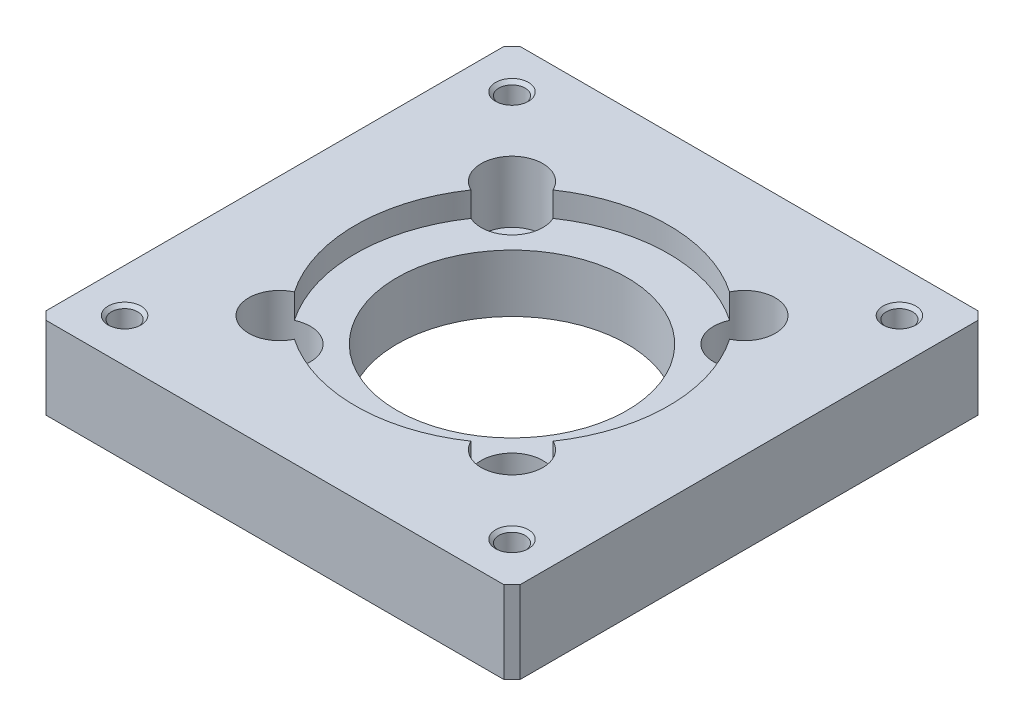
ISO-10303-21;
HEADER;
FILE_DESCRIPTION(('STEP AP214'),'2;1');
FILE_NAME('part.step','',(''),(''),'','','');
FILE_SCHEMA(('AUTOMOTIVE_DESIGN { 1 0 10303 214 1 1 1 1 }'));
ENDSEC;
DATA;
#1=APPLICATION_CONTEXT('core data for automotive mechanical design processes');
#2=APPLICATION_PROTOCOL_DEFINITION('international standard','automotive_design',2000,#1);
#3=PRODUCT_CONTEXT('',#1,'mechanical');
#4=PRODUCT('Part','Part','',(#3));
#5=PRODUCT_RELATED_PRODUCT_CATEGORY('part','',(#4));
#6=PRODUCT_DEFINITION_FORMATION('','',#4);
#7=PRODUCT_DEFINITION_CONTEXT('part definition',#1,'design');
#8=PRODUCT_DEFINITION('design','',#6,#7);
#9=PRODUCT_DEFINITION_SHAPE('','',#8);
#10=(LENGTH_UNIT() NAMED_UNIT(*) SI_UNIT(.MILLI.,.METRE.));
#11=(NAMED_UNIT(*) PLANE_ANGLE_UNIT() SI_UNIT($,.RADIAN.));
#12=(NAMED_UNIT(*) SI_UNIT($,.STERADIAN.) SOLID_ANGLE_UNIT());
#13=UNCERTAINTY_MEASURE_WITH_UNIT(LENGTH_MEASURE(1.E-05),#10,'distance_accuracy_value','');
#14=(GEOMETRIC_REPRESENTATION_CONTEXT(3) GLOBAL_UNCERTAINTY_ASSIGNED_CONTEXT((#13)) GLOBAL_UNIT_ASSIGNED_CONTEXT((#10,
#11,#12)) REPRESENTATION_CONTEXT('',''));
#15=CARTESIAN_POINT('',(0.,0.,0.));
#16=DIRECTION('',(0.,0.,1.));
#17=DIRECTION('',(1.,0.,0.));
#18=AXIS2_PLACEMENT_3D('',#15,#16,#17);
#19=CARTESIAN_POINT('',(-23.57,9.59999999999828,23.57));
#20=DIRECTION('',(0.,1.,0.));
#21=DIRECTION('',(0.,0.,1.));
#22=AXIS2_PLACEMENT_3D('',#19,#20,#21);
#23=CONICAL_SURFACE('',#22,1.60000000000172,0.785398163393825);
#24=CARTESIAN_POINT('',(-23.57,9.6,23.57));
#25=DIRECTION('',(0.,1.,0.));
#26=DIRECTION('',(1.,0.,0.));
#27=AXIS2_PLACEMENT_3D('',#24,#25,#26);
#28=CIRCLE('',#27,1.6);
#29=CARTESIAN_POINT('',(-21.97,9.6,23.57));
#30=VERTEX_POINT('',#29);
#31=EDGE_CURVE('E180',#30,#30,#28,.F.);
#32=ORIENTED_EDGE('',*,*,#31,.T.);
#33=EDGE_LOOP('',(#32));
#34=FACE_BOUND('',#33,.T.);
#35=CARTESIAN_POINT('',(-23.57,9.99999999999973,23.57));
#36=DIRECTION('',(0.,1.,0.));
#37=DIRECTION('',(-1.,0.,0.));
#38=AXIS2_PLACEMENT_3D('',#35,#36,#37);
#39=CIRCLE('',#38,2.00000000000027);
#40=CARTESIAN_POINT('',(-25.5700000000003,9.99999999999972,23.57));
#41=VERTEX_POINT('',#40);
#42=EDGE_CURVE('E204',#41,#41,#39,.T.);
#43=ORIENTED_EDGE('',*,*,#42,.T.);
#44=EDGE_LOOP('',(#43));
#45=FACE_BOUND('',#44,.T.);
#46=ADVANCED_FACE('F16',(#34,#45),#23,.F.);
#47=CARTESIAN_POINT('',(23.57,9.59999999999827,23.57));
#48=DIRECTION('',(0.,1.,0.));
#49=DIRECTION('',(-1.,0.,0.));
#50=AXIS2_PLACEMENT_3D('',#47,#48,#49);
#51=CONICAL_SURFACE('',#50,1.60000000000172,0.785398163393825);
#52=CARTESIAN_POINT('',(23.57,9.6,23.57));
#53=DIRECTION('',(0.,1.,0.));
#54=DIRECTION('',(1.,0.,0.));
#55=AXIS2_PLACEMENT_3D('',#52,#53,#54);
#56=CIRCLE('',#55,1.6);
#57=CARTESIAN_POINT('',(25.17,9.6,23.57));
#58=VERTEX_POINT('',#57);
#59=EDGE_CURVE('E253',#58,#58,#56,.F.);
#60=ORIENTED_EDGE('',*,*,#59,.T.);
#61=EDGE_LOOP('',(#60));
#62=FACE_BOUND('',#61,.T.);
#63=CARTESIAN_POINT('',(23.57,9.99999999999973,23.57));
#64=DIRECTION('',(0.,1.,0.));
#65=DIRECTION('',(-1.,0.,0.));
#66=AXIS2_PLACEMENT_3D('',#63,#64,#65);
#67=CIRCLE('',#66,2.00000000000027);
#68=CARTESIAN_POINT('',(21.5699999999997,9.99999999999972,23.57));
#69=VERTEX_POINT('',#68);
#70=EDGE_CURVE('E201',#69,#69,#67,.T.);
#71=ORIENTED_EDGE('',*,*,#70,.T.);
#72=EDGE_LOOP('',(#71));
#73=FACE_BOUND('',#72,.T.);
#74=ADVANCED_FACE('F442',(#62,#73),#51,.F.);
#75=CARTESIAN_POINT('',(23.57,9.59999999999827,-23.57));
#76=DIRECTION('',(0.,1.,0.));
#77=DIRECTION('',(0.,0.,1.));
#78=AXIS2_PLACEMENT_3D('',#75,#76,#77);
#79=CONICAL_SURFACE('',#78,1.60000000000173,0.785398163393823);
#80=CARTESIAN_POINT('',(23.57,9.6,-23.57));
#81=DIRECTION('',(0.,1.,0.));
#82=DIRECTION('',(1.,0.,0.));
#83=AXIS2_PLACEMENT_3D('',#80,#81,#82);
#84=CIRCLE('',#83,1.6);
#85=CARTESIAN_POINT('',(25.17,9.6,-23.57));
#86=VERTEX_POINT('',#85);
#87=EDGE_CURVE('E250',#86,#86,#84,.F.);
#88=ORIENTED_EDGE('',*,*,#87,.T.);
#89=EDGE_LOOP('',(#88));
#90=FACE_BOUND('',#89,.T.);
#91=CARTESIAN_POINT('',(23.57,9.99999999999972,-23.57));
#92=DIRECTION('',(0.,1.,0.));
#93=DIRECTION('',(0.,0.,1.));
#94=AXIS2_PLACEMENT_3D('',#91,#92,#93);
#95=CIRCLE('',#94,2.00000000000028);
#96=CARTESIAN_POINT('',(23.57,9.99999999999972,-21.5699999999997));
#97=VERTEX_POINT('',#96);
#98=EDGE_CURVE('E207',#97,#97,#95,.T.);
#99=ORIENTED_EDGE('',*,*,#98,.T.);
#100=EDGE_LOOP('',(#99));
#101=FACE_BOUND('',#100,.T.);
#102=ADVANCED_FACE('F482',(#90,#101),#79,.F.);
#103=CARTESIAN_POINT('',(-23.57,9.59999999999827,-23.57));
#104=DIRECTION('',(0.,1.,0.));
#105=DIRECTION('',(0.,0.,1.));
#106=AXIS2_PLACEMENT_3D('',#103,#104,#105);
#107=CONICAL_SURFACE('',#106,1.60000000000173,0.785398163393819);
#108=CARTESIAN_POINT('',(-23.57,9.6,-23.57));
#109=DIRECTION('',(0.,1.,0.));
#110=DIRECTION('',(1.,0.,0.));
#111=AXIS2_PLACEMENT_3D('',#108,#109,#110);
#112=CIRCLE('',#111,1.6);
#113=CARTESIAN_POINT('',(-21.97,9.6,-23.57));
#114=VERTEX_POINT('',#113);
#115=EDGE_CURVE('E176',#114,#114,#112,.F.);
#116=ORIENTED_EDGE('',*,*,#115,.T.);
#117=EDGE_LOOP('',(#116));
#118=FACE_BOUND('',#117,.T.);
#119=CARTESIAN_POINT('',(-23.57,9.99999999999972,-23.57));
#120=DIRECTION('',(0.,1.,0.));
#121=DIRECTION('',(0.,0.,1.));
#122=AXIS2_PLACEMENT_3D('',#119,#120,#121);
#123=CIRCLE('',#122,2.00000000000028);
#124=CARTESIAN_POINT('',(-23.57,9.99999999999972,-21.5699999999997));
#125=VERTEX_POINT('',#124);
#126=EDGE_CURVE('E177',#125,#125,#123,.T.);
#127=ORIENTED_EDGE('',*,*,#126,.T.);
#128=EDGE_LOOP('',(#127));
#129=FACE_BOUND('',#128,.T.);
#130=ADVANCED_FACE('F488',(#118,#129),#107,.F.);
#131=CARTESIAN_POINT('',(14.14213562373,2.5,-14.14213562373));
#132=DIRECTION('',(0.,1.,0.));
#133=DIRECTION('',(0.,0.,1.));
#134=AXIS2_PLACEMENT_3D('',#131,#132,#133);
#135=CYLINDRICAL_SURFACE('',#134,3.75);
#136=CARTESIAN_POINT('',(14.14213562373,2.5,-14.14213562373));
#137=DIRECTION('',(0.,1.,0.));
#138=DIRECTION('',(0.,0.,1.));
#139=AXIS2_PLACEMENT_3D('',#136,#137,#138);
#140=CIRCLE('',#139,3.75);
#141=CARTESIAN_POINT('',(14.14213562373,2.5,-10.39213562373));
#142=VERTEX_POINT('',#141);
#143=EDGE_CURVE('E173',#142,#142,#140,.F.);
#144=ORIENTED_EDGE('',*,*,#143,.T.);
#145=EDGE_LOOP('',(#144));
#146=FACE_BOUND('',#145,.T.);
#147=DIRECTION('',(0.,1.,0.));
#148=VECTOR('',#147,1.);
#149=CARTESIAN_POINT('',(10.7450909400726,8.4999999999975,-15.7304011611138));
#150=LINE('',#149,#148);
#151=CARTESIAN_POINT('',(10.7450909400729,10.,-15.7304011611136));
#152=VERTEX_POINT('',#151);
#153=CARTESIAN_POINT('',(10.7450909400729,7.,-15.7304011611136));
#154=VERTEX_POINT('',#153);
#155=EDGE_CURVE('E235',#152,#154,#150,.F.);
#156=ORIENTED_EDGE('',*,*,#155,.T.);
#157=CARTESIAN_POINT('',(14.14213562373,7.,-14.14213562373));
#158=DIRECTION('',(0.,1.,0.));
#159=DIRECTION('',(0.,0.,1.));
#160=AXIS2_PLACEMENT_3D('',#157,#158,#159);
#161=CIRCLE('',#160,3.75);
#162=CARTESIAN_POINT('',(15.7304011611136,7.,-10.7450909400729));
#163=VERTEX_POINT('',#162);
#164=EDGE_CURVE('E161',#154,#163,#161,.T.);
#165=ORIENTED_EDGE('',*,*,#164,.T.);
#166=DIRECTION('',(0.,-1.,0.));
#167=VECTOR('',#166,1.);
#168=CARTESIAN_POINT('',(15.7304011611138,8.4999999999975,-10.7450909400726));
#169=LINE('',#168,#167);
#170=CARTESIAN_POINT('',(15.7304011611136,10.,-10.7450909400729));
#171=VERTEX_POINT('',#170);
#172=EDGE_CURVE('E246',#163,#171,#169,.F.);
#173=ORIENTED_EDGE('',*,*,#172,.T.);
#174=CARTESIAN_POINT('',(14.14213562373,10.,-14.14213562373));
#175=DIRECTION('',(0.,1.,0.));
#176=DIRECTION('',(0.,0.,1.));
#177=AXIS2_PLACEMENT_3D('',#174,#175,#176);
#178=CIRCLE('',#177,3.75);
#179=EDGE_CURVE('E181',#171,#152,#178,.T.);
#180=ORIENTED_EDGE('',*,*,#179,.T.);
#181=EDGE_LOOP('',(#156,#165,#173,#180));
#182=FACE_BOUND('',#181,.T.);
#183=ADVANCED_FACE('F351',(#146,#182),#135,.F.);
#184=CARTESIAN_POINT('',(0.,7.,0.));
#185=DIRECTION('',(0.,1.,0.));
#186=DIRECTION('',(0.,0.,1.));
#187=AXIS2_PLACEMENT_3D('',#184,#185,#186);
#188=CYLINDRICAL_SURFACE('',#187,19.05);
#189=DIRECTION('',(0.,-1.,0.));
#190=VECTOR('',#189,1.);
#191=CARTESIAN_POINT('',(15.7304011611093,6.25,10.7450909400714));
#192=LINE('',#191,#190);
#193=CARTESIAN_POINT('',(15.7304011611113,7.,10.7450909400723));
#194=VERTEX_POINT('',#193);
#195=CARTESIAN_POINT('',(15.7304011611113,10.,10.7450909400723));
#196=VERTEX_POINT('',#195);
#197=EDGE_CURVE('E133',#194,#196,#192,.F.);
#198=ORIENTED_EDGE('',*,*,#197,.T.);
#199=CARTESIAN_POINT('',(0.,10.,0.));
#200=DIRECTION('',(0.,1.,0.));
#201=DIRECTION('',(0.,0.,1.));
#202=AXIS2_PLACEMENT_3D('',#199,#200,#201);
#203=CIRCLE('',#202,19.05);
#204=EDGE_CURVE('E183',#196,#171,#203,.T.);
#205=ORIENTED_EDGE('',*,*,#204,.T.);
#206=ORIENTED_EDGE('',*,*,#172,.F.);
#207=CARTESIAN_POINT('',(0.,7.,0.));
#208=DIRECTION('',(0.,1.,0.));
#209=DIRECTION('',(0.,0.,1.));
#210=AXIS2_PLACEMENT_3D('',#207,#208,#209);
#211=CIRCLE('',#210,19.05);
#212=EDGE_CURVE('E139',#163,#194,#211,.F.);
#213=ORIENTED_EDGE('',*,*,#212,.T.);
#214=EDGE_LOOP('',(#198,#205,#206,#213));
#215=FACE_BOUND('',#214,.T.);
#216=ADVANCED_FACE('F348',(#215),#188,.F.);
#217=CARTESIAN_POINT('',(14.14213562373,2.5,14.14213562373));
#218=DIRECTION('',(0.,1.,0.));
#219=DIRECTION('',(0.,0.,1.));
#220=AXIS2_PLACEMENT_3D('',#217,#218,#219);
#221=CYLINDRICAL_SURFACE('',#220,3.75);
#222=CARTESIAN_POINT('',(14.14213562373,2.5,14.14213562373));
#223=DIRECTION('',(0.,1.,0.));
#224=DIRECTION('',(0.,0.,1.));
#225=AXIS2_PLACEMENT_3D('',#222,#223,#224);
#226=CIRCLE('',#225,3.75);
#227=CARTESIAN_POINT('',(14.14213562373,2.5,17.89213562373));
#228=VERTEX_POINT('',#227);
#229=EDGE_CURVE('E170',#228,#228,#226,.F.);
#230=ORIENTED_EDGE('',*,*,#229,.T.);
#231=EDGE_LOOP('',(#230));
#232=FACE_BOUND('',#231,.T.);
#233=CARTESIAN_POINT('',(14.14213562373,7.,14.14213562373));
#234=DIRECTION('',(0.,1.,0.));
#235=DIRECTION('',(0.,0.,1.));
#236=AXIS2_PLACEMENT_3D('',#233,#234,#235);
#237=CIRCLE('',#236,3.75);
#238=CARTESIAN_POINT('',(10.7450909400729,7.,15.7304011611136));
#239=VERTEX_POINT('',#238);
#240=EDGE_CURVE('E127',#194,#239,#237,.T.);
#241=ORIENTED_EDGE('',*,*,#240,.T.);
#242=DIRECTION('',(0.,-1.,0.));
#243=VECTOR('',#242,1.);
#244=CARTESIAN_POINT('',(10.7450909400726,8.4999999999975,15.7304011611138));
#245=LINE('',#244,#243);
#246=CARTESIAN_POINT('',(10.7450909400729,10.,15.7304011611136));
#247=VERTEX_POINT('',#246);
#248=EDGE_CURVE('E131',#239,#247,#245,.F.);
#249=ORIENTED_EDGE('',*,*,#248,.T.);
#250=CARTESIAN_POINT('',(14.14213562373,10.,14.14213562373));
#251=DIRECTION('',(0.,1.,0.));
#252=DIRECTION('',(0.,0.,1.));
#253=AXIS2_PLACEMENT_3D('',#250,#251,#252);
#254=CIRCLE('',#253,3.75);
#255=EDGE_CURVE('E186',#247,#196,#254,.T.);
#256=ORIENTED_EDGE('',*,*,#255,.T.);
#257=ORIENTED_EDGE('',*,*,#197,.F.);
#258=EDGE_LOOP('',(#241,#249,#256,#257));
#259=FACE_BOUND('',#258,.T.);
#260=ADVANCED_FACE('F129',(#232,#259),#221,.F.);
#261=CARTESIAN_POINT('',(0.,7.,0.));
#262=DIRECTION('',(0.,1.,0.));
#263=DIRECTION('',(0.,0.,1.));
#264=AXIS2_PLACEMENT_3D('',#261,#262,#263);
#265=CYLINDRICAL_SURFACE('',#264,19.05);
#266=ORIENTED_EDGE('',*,*,#248,.F.);
#267=CARTESIAN_POINT('',(0.,7.,0.));
#268=DIRECTION('',(0.,1.,0.));
#269=DIRECTION('',(0.,0.,1.));
#270=AXIS2_PLACEMENT_3D('',#267,#268,#269);
#271=CIRCLE('',#270,19.05);
#272=CARTESIAN_POINT('',(-10.7450909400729,7.,15.7304011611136));
#273=VERTEX_POINT('',#272);
#274=EDGE_CURVE('E138',#239,#273,#271,.F.);
#275=ORIENTED_EDGE('',*,*,#274,.T.);
#276=DIRECTION('',(0.,1.,0.));
#277=VECTOR('',#276,1.);
#278=CARTESIAN_POINT('',(-10.7450909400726,8.4999999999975,15.7304011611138));
#279=LINE('',#278,#277);
#280=CARTESIAN_POINT('',(-10.7450909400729,10.,15.7304011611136));
#281=VERTEX_POINT('',#280);
#282=EDGE_CURVE('E147',#281,#273,#279,.F.);
#283=ORIENTED_EDGE('',*,*,#282,.F.);
#284=CARTESIAN_POINT('',(0.,10.,0.));
#285=DIRECTION('',(0.,1.,0.));
#286=DIRECTION('',(0.,0.,1.));
#287=AXIS2_PLACEMENT_3D('',#284,#285,#286);
#288=CIRCLE('',#287,19.05);
#289=EDGE_CURVE('E145',#281,#247,#288,.T.);
#290=ORIENTED_EDGE('',*,*,#289,.T.);
#291=EDGE_LOOP('',(#266,#275,#283,#290));
#292=FACE_BOUND('',#291,.T.);
#293=ADVANCED_FACE('F143',(#292),#265,.F.);
#294=CARTESIAN_POINT('',(-14.14213562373,2.5,14.14213562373));
#295=DIRECTION('',(0.,1.,0.));
#296=DIRECTION('',(0.,0.,1.));
#297=AXIS2_PLACEMENT_3D('',#294,#295,#296);
#298=CYLINDRICAL_SURFACE('',#297,3.75);
#299=CARTESIAN_POINT('',(-14.14213562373,2.5,14.14213562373));
#300=DIRECTION('',(0.,1.,0.));
#301=DIRECTION('',(0.,0.,1.));
#302=AXIS2_PLACEMENT_3D('',#299,#300,#301);
#303=CIRCLE('',#302,3.75);
#304=CARTESIAN_POINT('',(-14.14213562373,2.5,17.89213562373));
#305=VERTEX_POINT('',#304);
#306=EDGE_CURVE('E164',#305,#305,#303,.F.);
#307=ORIENTED_EDGE('',*,*,#306,.T.);
#308=EDGE_LOOP('',(#307));
#309=FACE_BOUND('',#308,.T.);
#310=ORIENTED_EDGE('',*,*,#282,.T.);
#311=CARTESIAN_POINT('',(-14.14213562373,7.,14.14213562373));
#312=DIRECTION('',(0.,1.,0.));
#313=DIRECTION('',(0.,0.,1.));
#314=AXIS2_PLACEMENT_3D('',#311,#312,#313);
#315=CIRCLE('',#314,3.75);
#316=CARTESIAN_POINT('',(-15.7304011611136,7.,10.7450909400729));
#317=VERTEX_POINT('',#316);
#318=EDGE_CURVE('E153',#273,#317,#315,.T.);
#319=ORIENTED_EDGE('',*,*,#318,.T.);
#320=DIRECTION('',(0.,-1.,0.));
#321=VECTOR('',#320,1.);
#322=CARTESIAN_POINT('',(-15.7304011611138,8.4999999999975,10.7450909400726));
#323=LINE('',#322,#321);
#324=CARTESIAN_POINT('',(-15.7304011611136,10.,10.7450909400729));
#325=VERTEX_POINT('',#324);
#326=EDGE_CURVE('E146',#317,#325,#323,.F.);
#327=ORIENTED_EDGE('',*,*,#326,.T.);
#328=CARTESIAN_POINT('',(-14.14213562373,10.,14.14213562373));
#329=DIRECTION('',(0.,1.,0.));
#330=DIRECTION('',(0.,0.,1.));
#331=AXIS2_PLACEMENT_3D('',#328,#329,#330);
#332=CIRCLE('',#331,3.75);
#333=EDGE_CURVE('E189',#325,#281,#332,.T.);
#334=ORIENTED_EDGE('',*,*,#333,.T.);
#335=EDGE_LOOP('',(#310,#319,#327,#334));
#336=FACE_BOUND('',#335,.T.);
#337=ADVANCED_FACE('F340',(#309,#336),#298,.F.);
#338=CARTESIAN_POINT('',(0.,7.,0.));
#339=DIRECTION('',(0.,1.,0.));
#340=DIRECTION('',(0.,0.,1.));
#341=AXIS2_PLACEMENT_3D('',#338,#339,#340);
#342=CYLINDRICAL_SURFACE('',#341,19.05);
#343=ORIENTED_EDGE('',*,*,#326,.F.);
#344=CARTESIAN_POINT('',(0.,7.,0.));
#345=DIRECTION('',(0.,1.,0.));
#346=DIRECTION('',(0.,0.,1.));
#347=AXIS2_PLACEMENT_3D('',#344,#345,#346);
#348=CIRCLE('',#347,19.05);
#349=CARTESIAN_POINT('',(-15.7304011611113,7.,-10.7450909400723));
#350=VERTEX_POINT('',#349);
#351=EDGE_CURVE('E156',#317,#350,#348,.F.);
#352=ORIENTED_EDGE('',*,*,#351,.T.);
#353=DIRECTION('',(0.,-1.,0.));
#354=VECTOR('',#353,1.);
#355=CARTESIAN_POINT('',(-15.7304011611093,6.25,-10.7450909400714));
#356=LINE('',#355,#354);
#357=CARTESIAN_POINT('',(-15.7304011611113,10.,-10.7450909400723));
#358=VERTEX_POINT('',#357);
#359=EDGE_CURVE('E238',#350,#358,#356,.F.);
#360=ORIENTED_EDGE('',*,*,#359,.T.);
#361=CARTESIAN_POINT('',(0.,10.,0.));
#362=DIRECTION('',(0.,1.,0.));
#363=DIRECTION('',(0.,0.,1.));
#364=AXIS2_PLACEMENT_3D('',#361,#362,#363);
#365=CIRCLE('',#364,19.05);
#366=EDGE_CURVE('E192',#358,#325,#365,.T.);
#367=ORIENTED_EDGE('',*,*,#366,.T.);
#368=EDGE_LOOP('',(#343,#352,#360,#367));
#369=FACE_BOUND('',#368,.T.);
#370=ADVANCED_FACE('F336',(#369),#342,.F.);
#371=CARTESIAN_POINT('',(-14.14213562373,2.5,-14.14213562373));
#372=DIRECTION('',(0.,1.,0.));
#373=DIRECTION('',(0.,0.,1.));
#374=AXIS2_PLACEMENT_3D('',#371,#372,#373);
#375=CYLINDRICAL_SURFACE('',#374,3.75);
#376=CARTESIAN_POINT('',(-14.14213562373,2.5,-14.14213562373));
#377=DIRECTION('',(0.,1.,0.));
#378=DIRECTION('',(0.,0.,1.));
#379=AXIS2_PLACEMENT_3D('',#376,#377,#378);
#380=CIRCLE('',#379,3.75);
#381=CARTESIAN_POINT('',(-14.14213562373,2.5,-10.39213562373));
#382=VERTEX_POINT('',#381);
#383=EDGE_CURVE('E167',#382,#382,#380,.F.);
#384=ORIENTED_EDGE('',*,*,#383,.T.);
#385=EDGE_LOOP('',(#384));
#386=FACE_BOUND('',#385,.T.);
#387=CARTESIAN_POINT('',(-14.14213562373,7.,-14.14213562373));
#388=DIRECTION('',(0.,1.,0.));
#389=DIRECTION('',(0.,0.,1.));
#390=AXIS2_PLACEMENT_3D('',#387,#388,#389);
#391=CIRCLE('',#390,3.75);
#392=CARTESIAN_POINT('',(-10.7450909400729,7.,-15.7304011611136));
#393=VERTEX_POINT('',#392);
#394=EDGE_CURVE('E333',#350,#393,#391,.T.);
#395=ORIENTED_EDGE('',*,*,#394,.T.);
#396=DIRECTION('',(0.,-1.,0.));
#397=VECTOR('',#396,1.);
#398=CARTESIAN_POINT('',(-10.7450909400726,8.4999999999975,-15.7304011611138));
#399=LINE('',#398,#397);
#400=CARTESIAN_POINT('',(-10.7450909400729,10.,-15.7304011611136));
#401=VERTEX_POINT('',#400);
#402=EDGE_CURVE('E234',#393,#401,#399,.F.);
#403=ORIENTED_EDGE('',*,*,#402,.T.);
#404=CARTESIAN_POINT('',(-14.14213562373,10.,-14.14213562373));
#405=DIRECTION('',(0.,1.,0.));
#406=DIRECTION('',(0.,0.,1.));
#407=AXIS2_PLACEMENT_3D('',#404,#405,#406);
#408=CIRCLE('',#407,3.75);
#409=EDGE_CURVE('E195',#401,#358,#408,.T.);
#410=ORIENTED_EDGE('',*,*,#409,.T.);
#411=ORIENTED_EDGE('',*,*,#359,.F.);
#412=EDGE_LOOP('',(#395,#403,#410,#411));
#413=FACE_BOUND('',#412,.T.);
#414=ADVANCED_FACE('F357',(#386,#413),#375,.F.);
#415=CARTESIAN_POINT('',(0.,7.,0.));
#416=DIRECTION('',(0.,1.,0.));
#417=DIRECTION('',(0.,0.,1.));
#418=AXIS2_PLACEMENT_3D('',#415,#416,#417);
#419=CYLINDRICAL_SURFACE('',#418,19.05);
#420=ORIENTED_EDGE('',*,*,#402,.F.);
#421=CARTESIAN_POINT('',(0.,7.,0.));
#422=DIRECTION('',(0.,1.,0.));
#423=DIRECTION('',(0.,0.,1.));
#424=AXIS2_PLACEMENT_3D('',#421,#422,#423);
#425=CIRCLE('',#424,19.05);
#426=EDGE_CURVE('E288',#393,#154,#425,.F.);
#427=ORIENTED_EDGE('',*,*,#426,.T.);
#428=ORIENTED_EDGE('',*,*,#155,.F.);
#429=CARTESIAN_POINT('',(0.,10.,0.));
#430=DIRECTION('',(0.,1.,0.));
#431=DIRECTION('',(0.,0.,1.));
#432=AXIS2_PLACEMENT_3D('',#429,#430,#431);
#433=CIRCLE('',#432,19.05);
#434=EDGE_CURVE('E198',#152,#401,#433,.T.);
#435=ORIENTED_EDGE('',*,*,#434,.T.);
#436=EDGE_LOOP('',(#420,#427,#428,#435));
#437=FACE_BOUND('',#436,.T.);
#438=ADVANCED_FACE('F355',(#437),#419,.F.);
#439=CARTESIAN_POINT('',(-28.926164,10.2,-27.773836));
#440=DIRECTION('',(-0.707106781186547,0.,-0.707106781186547));
#441=DIRECTION('',(0.707106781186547,0.,-0.707106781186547));
#442=AXIS2_PLACEMENT_3D('',#439,#440,#441);
#443=PLANE('',#442);
#444=DIRECTION('',(0.707106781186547,0.,-0.707106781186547));
#445=VECTOR('',#444,1.);
#446=CARTESIAN_POINT('',(-28.926164,10.,-27.773836));
#447=LINE('',#446,#445);
#448=CARTESIAN_POINT('',(-28.85,10.,-27.85));
#449=VERTEX_POINT('',#448);
#450=CARTESIAN_POINT('',(-27.85,10.,-28.85));
#451=VERTEX_POINT('',#450);
#452=EDGE_CURVE('E210',#449,#451,#447,.T.);
#453=ORIENTED_EDGE('',*,*,#452,.T.);
#454=DIRECTION('',(0.,1.,0.));
#455=VECTOR('',#454,1.);
#456=CARTESIAN_POINT('',(-27.85,5.,-28.85));
#457=LINE('',#456,#455);
#458=CARTESIAN_POINT('',(-27.85,0.,-28.85));
#459=VERTEX_POINT('',#458);
#460=EDGE_CURVE('E265',#451,#459,#457,.F.);
#461=ORIENTED_EDGE('',*,*,#460,.T.);
#462=DIRECTION('',(-0.707106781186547,0.,0.707106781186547));
#463=VECTOR('',#462,1.);
#464=CARTESIAN_POINT('',(-28.35,0.,-28.35));
#465=LINE('',#464,#463);
#466=CARTESIAN_POINT('',(-28.85,0.,-27.85));
#467=VERTEX_POINT('',#466);
#468=EDGE_CURVE('E232',#467,#459,#465,.F.);
#469=ORIENTED_EDGE('',*,*,#468,.F.);
#470=DIRECTION('',(0.,-1.,0.));
#471=VECTOR('',#470,1.);
#472=CARTESIAN_POINT('',(-28.85,5.,-27.85));
#473=LINE('',#472,#471);
#474=EDGE_CURVE('E262',#467,#449,#473,.F.);
#475=ORIENTED_EDGE('',*,*,#474,.T.);
#476=EDGE_LOOP('',(#453,#461,#469,#475));
#477=FACE_BOUND('',#476,.T.);
#478=ADVANCED_FACE('F366',(#477),#443,.T.);
#479=CARTESIAN_POINT('',(-27.773836,10.2,28.926164));
#480=DIRECTION('',(-0.707106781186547,0.,0.707106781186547));
#481=DIRECTION('',(-0.707106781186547,0.,-0.707106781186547));
#482=AXIS2_PLACEMENT_3D('',#479,#480,#481);
#483=PLANE('',#482);
#484=DIRECTION('',(-0.707106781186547,0.,-0.707106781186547));
#485=VECTOR('',#484,1.);
#486=CARTESIAN_POINT('',(-27.773836,10.,28.926164));
#487=LINE('',#486,#485);
#488=CARTESIAN_POINT('',(-27.85,10.,28.85));
#489=VERTEX_POINT('',#488);
#490=CARTESIAN_POINT('',(-28.85,10.,27.85));
#491=VERTEX_POINT('',#490);
#492=EDGE_CURVE('E212',#489,#491,#487,.T.);
#493=ORIENTED_EDGE('',*,*,#492,.T.);
#494=DIRECTION('',(0.,1.,0.));
#495=VECTOR('',#494,1.);
#496=CARTESIAN_POINT('',(-28.85,5.,27.85));
#497=LINE('',#496,#495);
#498=CARTESIAN_POINT('',(-28.85,0.,27.85));
#499=VERTEX_POINT('',#498);
#500=EDGE_CURVE('E261',#491,#499,#497,.F.);
#501=ORIENTED_EDGE('',*,*,#500,.T.);
#502=DIRECTION('',(0.707106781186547,0.,0.707106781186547));
#503=VECTOR('',#502,1.);
#504=CARTESIAN_POINT('',(-28.35,0.,28.35));
#505=LINE('',#504,#503);
#506=CARTESIAN_POINT('',(-27.85,0.,28.85));
#507=VERTEX_POINT('',#506);
#508=EDGE_CURVE('E225',#507,#499,#505,.F.);
#509=ORIENTED_EDGE('',*,*,#508,.F.);
#510=DIRECTION('',(0.,-1.,0.));
#511=VECTOR('',#510,1.);
#512=CARTESIAN_POINT('',(-27.85,5.,28.85));
#513=LINE('',#512,#511);
#514=EDGE_CURVE('E276',#507,#489,#513,.F.);
#515=ORIENTED_EDGE('',*,*,#514,.T.);
#516=EDGE_LOOP('',(#493,#501,#509,#515));
#517=FACE_BOUND('',#516,.T.);
#518=ADVANCED_FACE('F495',(#517),#483,.T.);
#519=CARTESIAN_POINT('',(27.773836,10.2,-28.926164));
#520=DIRECTION('',(0.707106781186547,0.,-0.707106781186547));
#521=DIRECTION('',(0.707106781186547,0.,0.707106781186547));
#522=AXIS2_PLACEMENT_3D('',#519,#520,#521);
#523=PLANE('',#522);
#524=DIRECTION('',(0.707106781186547,0.,0.707106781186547));
#525=VECTOR('',#524,1.);
#526=CARTESIAN_POINT('',(27.773836,10.,-28.926164));
#527=LINE('',#526,#525);
#528=CARTESIAN_POINT('',(27.85,10.,-28.85));
#529=VERTEX_POINT('',#528);
#530=CARTESIAN_POINT('',(28.85,10.,-27.85));
#531=VERTEX_POINT('',#530);
#532=EDGE_CURVE('E20',#529,#531,#527,.T.);
#533=ORIENTED_EDGE('',*,*,#532,.T.);
#534=DIRECTION('',(0.,1.,0.));
#535=VECTOR('',#534,1.);
#536=CARTESIAN_POINT('',(28.85,5.,-27.85));
#537=LINE('',#536,#535);
#538=CARTESIAN_POINT('',(28.85,0.,-27.85));
#539=VERTEX_POINT('',#538);
#540=EDGE_CURVE('E285',#531,#539,#537,.F.);
#541=ORIENTED_EDGE('',*,*,#540,.T.);
#542=DIRECTION('',(-0.707106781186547,0.,-0.707106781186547));
#543=VECTOR('',#542,1.);
#544=CARTESIAN_POINT('',(28.35,0.,-28.35));
#545=LINE('',#544,#543);
#546=CARTESIAN_POINT('',(27.85,0.,-28.85));
#547=VERTEX_POINT('',#546);
#548=EDGE_CURVE('E220',#547,#539,#545,.F.);
#549=ORIENTED_EDGE('',*,*,#548,.F.);
#550=DIRECTION('',(0.,-1.,0.));
#551=VECTOR('',#550,1.);
#552=CARTESIAN_POINT('',(27.85,5.,-28.85));
#553=LINE('',#552,#551);
#554=EDGE_CURVE('E271',#547,#529,#553,.F.);
#555=ORIENTED_EDGE('',*,*,#554,.T.);
#556=EDGE_LOOP('',(#533,#541,#549,#555));
#557=FACE_BOUND('',#556,.T.);
#558=ADVANCED_FACE('F498',(#557),#523,.T.);
#559=CARTESIAN_POINT('',(28.926164,10.2,27.773836));
#560=DIRECTION('',(0.707106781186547,0.,0.707106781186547));
#561=DIRECTION('',(-0.707106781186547,0.,0.707106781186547));
#562=AXIS2_PLACEMENT_3D('',#559,#560,#561);
#563=PLANE('',#562);
#564=DIRECTION('',(-0.707106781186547,0.,0.707106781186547));
#565=VECTOR('',#564,1.);
#566=CARTESIAN_POINT('',(28.926164,10.,27.773836));
#567=LINE('',#566,#565);
#568=CARTESIAN_POINT('',(28.85,10.,27.85));
#569=VERTEX_POINT('',#568);
#570=CARTESIAN_POINT('',(27.85,10.,28.85));
#571=VERTEX_POINT('',#570);
#572=EDGE_CURVE('E213',#569,#571,#567,.T.);
#573=ORIENTED_EDGE('',*,*,#572,.T.);
#574=DIRECTION('',(0.,1.,0.));
#575=VECTOR('',#574,1.);
#576=CARTESIAN_POINT('',(27.85,5.,28.85));
#577=LINE('',#576,#575);
#578=CARTESIAN_POINT('',(27.85,0.,28.85));
#579=VERTEX_POINT('',#578);
#580=EDGE_CURVE('E275',#571,#579,#577,.F.);
#581=ORIENTED_EDGE('',*,*,#580,.T.);
#582=DIRECTION('',(0.707106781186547,0.,-0.707106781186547));
#583=VECTOR('',#582,1.);
#584=CARTESIAN_POINT('',(28.35,0.,28.35));
#585=LINE('',#584,#583);
#586=CARTESIAN_POINT('',(28.85,0.,27.85));
#587=VERTEX_POINT('',#586);
#588=EDGE_CURVE('E35',#587,#579,#585,.F.);
#589=ORIENTED_EDGE('',*,*,#588,.F.);
#590=DIRECTION('',(0.,-1.,0.));
#591=VECTOR('',#590,1.);
#592=CARTESIAN_POINT('',(28.85,5.,27.85));
#593=LINE('',#592,#591);
#594=EDGE_CURVE('E283',#587,#569,#593,.F.);
#595=ORIENTED_EDGE('',*,*,#594,.T.);
#596=EDGE_LOOP('',(#573,#581,#589,#595));
#597=FACE_BOUND('',#596,.T.);
#598=ADVANCED_FACE('F433',(#597),#563,.T.);
#599=CARTESIAN_POINT('',(-30.004,10.,30.004));
#600=DIRECTION('',(0.,1.,0.));
#601=DIRECTION('',(1.,0.,0.));
#602=AXIS2_PLACEMENT_3D('',#599,#600,#601);
#603=PLANE('',#602);
#604=ORIENTED_EDGE('',*,*,#126,.F.);
#605=EDGE_LOOP('',(#604));
#606=FACE_BOUND('',#605,.T.);
#607=ORIENTED_EDGE('',*,*,#204,.F.);
#608=ORIENTED_EDGE('',*,*,#255,.F.);
#609=ORIENTED_EDGE('',*,*,#289,.F.);
#610=ORIENTED_EDGE('',*,*,#333,.F.);
#611=ORIENTED_EDGE('',*,*,#366,.F.);
#612=ORIENTED_EDGE('',*,*,#409,.F.);
#613=ORIENTED_EDGE('',*,*,#434,.F.);
#614=ORIENTED_EDGE('',*,*,#179,.F.);
#615=EDGE_LOOP('',(#607,#608,#609,#610,#611,#612,#613,#614));
#616=FACE_BOUND('',#615,.T.);
#617=ORIENTED_EDGE('',*,*,#70,.F.);
#618=EDGE_LOOP('',(#617));
#619=FACE_BOUND('',#618,.T.);
#620=ORIENTED_EDGE('',*,*,#42,.F.);
#621=EDGE_LOOP('',(#620));
#622=FACE_BOUND('',#621,.T.);
#623=ORIENTED_EDGE('',*,*,#98,.F.);
#624=EDGE_LOOP('',(#623));
#625=FACE_BOUND('',#624,.T.);
#626=ORIENTED_EDGE('',*,*,#452,.F.);
#627=DIRECTION('',(0.,0.,-1.));
#628=VECTOR('',#627,1.);
#629=CARTESIAN_POINT('',(-28.85,10.,0.));
#630=LINE('',#629,#628);
#631=EDGE_CURVE('E258',#449,#491,#630,.F.);
#632=ORIENTED_EDGE('',*,*,#631,.T.);
#633=ORIENTED_EDGE('',*,*,#492,.F.);
#634=DIRECTION('',(-1.,0.,0.));
#635=VECTOR('',#634,1.);
#636=CARTESIAN_POINT('',(0.,10.,28.85));
#637=LINE('',#636,#635);
#638=EDGE_CURVE('E272',#489,#571,#637,.F.);
#639=ORIENTED_EDGE('',*,*,#638,.T.);
#640=ORIENTED_EDGE('',*,*,#572,.F.);
#641=DIRECTION('',(0.,0.,1.));
#642=VECTOR('',#641,1.);
#643=CARTESIAN_POINT('',(28.85,10.,0.));
#644=LINE('',#643,#642);
#645=EDGE_CURVE('E281',#569,#531,#644,.F.);
#646=ORIENTED_EDGE('',*,*,#645,.T.);
#647=ORIENTED_EDGE('',*,*,#532,.F.);
#648=DIRECTION('',(1.,0.,0.));
#649=VECTOR('',#648,1.);
#650=CARTESIAN_POINT('',(0.,10.,-28.85));
#651=LINE('',#650,#649);
#652=EDGE_CURVE('E268',#529,#451,#651,.F.);
#653=ORIENTED_EDGE('',*,*,#652,.T.);
#654=EDGE_LOOP('',(#626,#632,#633,#639,#640,#646,#647,#653));
#655=FACE_BOUND('',#654,.T.);
#656=ADVANCED_FACE('F343',(#606,#616,#619,#622,#625,#655),#603,.T.);
#657=CARTESIAN_POINT('',(-23.57,0.399999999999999,23.57));
#658=DIRECTION('',(0.,1.,0.));
#659=DIRECTION('',(0.,0.,1.));
#660=AXIS2_PLACEMENT_3D('',#657,#658,#659);
#661=CYLINDRICAL_SURFACE('',#660,1.6);
#662=CARTESIAN_POINT('',(-23.57,0.400000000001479,23.57));
#663=DIRECTION('',(0.,-1.,0.));
#664=DIRECTION('',(0.,0.,-1.));
#665=AXIS2_PLACEMENT_3D('',#662,#663,#664);
#666=CIRCLE('',#665,1.60000000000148);
#667=CARTESIAN_POINT('',(-23.57,0.400000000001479,21.9699999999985));
#668=VERTEX_POINT('',#667);
#669=EDGE_CURVE('E228',#668,#668,#666,.T.);
#670=ORIENTED_EDGE('',*,*,#669,.T.);
#671=EDGE_LOOP('',(#670));
#672=FACE_BOUND('',#671,.T.);
#673=ORIENTED_EDGE('',*,*,#31,.F.);
#674=EDGE_LOOP('',(#673));
#675=FACE_BOUND('',#674,.T.);
#676=ADVANCED_FACE('F426',(#672,#675),#661,.F.);
#677=CARTESIAN_POINT('',(23.57,0.399999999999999,23.57));
#678=DIRECTION('',(0.,1.,0.));
#679=DIRECTION('',(0.,0.,1.));
#680=AXIS2_PLACEMENT_3D('',#677,#678,#679);
#681=CYLINDRICAL_SURFACE('',#680,1.6);
#682=CARTESIAN_POINT('',(23.57,0.400000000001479,23.57));
#683=DIRECTION('',(0.,-1.,0.));
#684=DIRECTION('',(0.,0.,-1.));
#685=AXIS2_PLACEMENT_3D('',#682,#683,#684);
#686=CIRCLE('',#685,1.60000000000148);
#687=CARTESIAN_POINT('',(23.57,0.400000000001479,21.9699999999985));
#688=VERTEX_POINT('',#687);
#689=EDGE_CURVE('E473',#688,#688,#686,.T.);
#690=ORIENTED_EDGE('',*,*,#689,.T.);
#691=EDGE_LOOP('',(#690));
#692=FACE_BOUND('',#691,.T.);
#693=ORIENTED_EDGE('',*,*,#59,.F.);
#694=EDGE_LOOP('',(#693));
#695=FACE_BOUND('',#694,.T.);
#696=ADVANCED_FACE('F422',(#692,#695),#681,.F.);
#697=CARTESIAN_POINT('',(23.57,0.399999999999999,-23.57));
#698=DIRECTION('',(0.,1.,0.));
#699=DIRECTION('',(0.,0.,1.));
#700=AXIS2_PLACEMENT_3D('',#697,#698,#699);
#701=CYLINDRICAL_SURFACE('',#700,1.6);
#702=CARTESIAN_POINT('',(23.57,0.400000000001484,-23.57));
#703=DIRECTION('',(0.,-1.,0.));
#704=DIRECTION('',(0.,0.,-1.));
#705=AXIS2_PLACEMENT_3D('',#702,#703,#704);
#706=CIRCLE('',#705,1.60000000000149);
#707=CARTESIAN_POINT('',(23.57,0.400000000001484,-25.1700000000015));
#708=VERTEX_POINT('',#707);
#709=EDGE_CURVE('E471',#708,#708,#706,.T.);
#710=ORIENTED_EDGE('',*,*,#709,.T.);
#711=EDGE_LOOP('',(#710));
#712=FACE_BOUND('',#711,.T.);
#713=ORIENTED_EDGE('',*,*,#87,.F.);
#714=EDGE_LOOP('',(#713));
#715=FACE_BOUND('',#714,.T.);
#716=ADVANCED_FACE('F418',(#712,#715),#701,.F.);
#717=CARTESIAN_POINT('',(-23.57,0.399999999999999,-23.57));
#718=DIRECTION('',(0.,1.,0.));
#719=DIRECTION('',(0.,0.,1.));
#720=AXIS2_PLACEMENT_3D('',#717,#718,#719);
#721=CYLINDRICAL_SURFACE('',#720,1.6);
#722=CARTESIAN_POINT('',(-23.57,0.400000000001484,-23.57));
#723=DIRECTION('',(0.,-1.,0.));
#724=DIRECTION('',(0.,0.,-1.));
#725=AXIS2_PLACEMENT_3D('',#722,#723,#724);
#726=CIRCLE('',#725,1.60000000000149);
#727=CARTESIAN_POINT('',(-23.57,0.400000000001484,-25.1700000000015));
#728=VERTEX_POINT('',#727);
#729=EDGE_CURVE('E330',#728,#728,#726,.T.);
#730=ORIENTED_EDGE('',*,*,#729,.T.);
#731=EDGE_LOOP('',(#730));
#732=FACE_BOUND('',#731,.T.);
#733=ORIENTED_EDGE('',*,*,#115,.F.);
#734=EDGE_LOOP('',(#733));
#735=FACE_BOUND('',#734,.T.);
#736=ADVANCED_FACE('F414',(#732,#735),#721,.F.);
#737=CARTESIAN_POINT('',(-18.60782104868,2.5,18.61594836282));
#738=DIRECTION('',(0.,1.,0.));
#739=DIRECTION('',(1.,0.,0.));
#740=AXIS2_PLACEMENT_3D('',#737,#738,#739);
#741=PLANE('',#740);
#742=CARTESIAN_POINT('',(14.14213562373,2.5,-14.14213562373));
#743=DIRECTION('',(0.,1.,0.));
#744=DIRECTION('',(0.,0.,1.));
#745=AXIS2_PLACEMENT_3D('',#742,#743,#744);
#746=CIRCLE('',#745,2.25);
#747=CARTESIAN_POINT('',(14.14213562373,2.5,-11.89213562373));
#748=VERTEX_POINT('',#747);
#749=EDGE_CURVE('E327',#748,#748,#746,.F.);
#750=ORIENTED_EDGE('',*,*,#749,.T.);
#751=EDGE_LOOP('',(#750));
#752=FACE_BOUND('',#751,.T.);
#753=ORIENTED_EDGE('',*,*,#143,.F.);
#754=EDGE_LOOP('',(#753));
#755=FACE_BOUND('',#754,.T.);
#756=ADVANCED_FACE('F417',(#752,#755),#741,.T.);
#757=CARTESIAN_POINT('',(-18.60782104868,2.5,18.61594836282));
#758=DIRECTION('',(0.,1.,0.));
#759=DIRECTION('',(1.,0.,0.));
#760=AXIS2_PLACEMENT_3D('',#757,#758,#759);
#761=PLANE('',#760);
#762=CARTESIAN_POINT('',(14.14213562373,2.5,14.14213562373));
#763=DIRECTION('',(0.,1.,0.));
#764=DIRECTION('',(0.,0.,1.));
#765=AXIS2_PLACEMENT_3D('',#762,#763,#764);
#766=CIRCLE('',#765,2.25);
#767=CARTESIAN_POINT('',(14.14213562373,2.5,16.39213562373));
#768=VERTEX_POINT('',#767);
#769=EDGE_CURVE('E324',#768,#768,#766,.F.);
#770=ORIENTED_EDGE('',*,*,#769,.T.);
#771=EDGE_LOOP('',(#770));
#772=FACE_BOUND('',#771,.T.);
#773=ORIENTED_EDGE('',*,*,#229,.F.);
#774=EDGE_LOOP('',(#773));
#775=FACE_BOUND('',#774,.T.);
#776=ADVANCED_FACE('F506',(#772,#775),#761,.T.);
#777=CARTESIAN_POINT('',(-18.60782104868,2.5,18.61594836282));
#778=DIRECTION('',(0.,1.,0.));
#779=DIRECTION('',(1.,0.,0.));
#780=AXIS2_PLACEMENT_3D('',#777,#778,#779);
#781=PLANE('',#780);
#782=CARTESIAN_POINT('',(-14.14213562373,2.5,-14.14213562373));
#783=DIRECTION('',(0.,1.,0.));
#784=DIRECTION('',(0.,0.,1.));
#785=AXIS2_PLACEMENT_3D('',#782,#783,#784);
#786=CIRCLE('',#785,2.25);
#787=CARTESIAN_POINT('',(-14.14213562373,2.5,-11.89213562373));
#788=VERTEX_POINT('',#787);
#789=EDGE_CURVE('E321',#788,#788,#786,.F.);
#790=ORIENTED_EDGE('',*,*,#789,.T.);
#791=EDGE_LOOP('',(#790));
#792=FACE_BOUND('',#791,.T.);
#793=ORIENTED_EDGE('',*,*,#383,.F.);
#794=EDGE_LOOP('',(#793));
#795=FACE_BOUND('',#794,.T.);
#796=ADVANCED_FACE('F510',(#792,#795),#781,.T.);
#797=CARTESIAN_POINT('',(-18.60782104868,2.5,18.61594836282));
#798=DIRECTION('',(0.,1.,0.));
#799=DIRECTION('',(1.,0.,0.));
#800=AXIS2_PLACEMENT_3D('',#797,#798,#799);
#801=PLANE('',#800);
#802=CARTESIAN_POINT('',(-14.14213562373,2.5,14.14213562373));
#803=DIRECTION('',(0.,1.,0.));
#804=DIRECTION('',(0.,0.,1.));
#805=AXIS2_PLACEMENT_3D('',#802,#803,#804);
#806=CIRCLE('',#805,2.25);
#807=CARTESIAN_POINT('',(-14.14213562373,2.5,16.39213562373));
#808=VERTEX_POINT('',#807);
#809=EDGE_CURVE('E318',#808,#808,#806,.F.);
#810=ORIENTED_EDGE('',*,*,#809,.T.);
#811=EDGE_LOOP('',(#810));
#812=FACE_BOUND('',#811,.T.);
#813=ORIENTED_EDGE('',*,*,#306,.F.);
#814=EDGE_LOOP('',(#813));
#815=FACE_BOUND('',#814,.T.);
#816=ADVANCED_FACE('F514',(#812,#815),#801,.T.);
#817=CARTESIAN_POINT('',(-19.812,7.,19.812));
#818=DIRECTION('',(0.,1.,0.));
#819=DIRECTION('',(1.,0.,0.));
#820=AXIS2_PLACEMENT_3D('',#817,#818,#819);
#821=PLANE('',#820);
#822=CARTESIAN_POINT('',(0.,7.,0.));
#823=DIRECTION('',(0.,1.,0.));
#824=DIRECTION('',(0.,0.,1.));
#825=AXIS2_PLACEMENT_3D('',#822,#823,#824);
#826=CIRCLE('',#825,14.);
#827=CARTESIAN_POINT('',(0.,7.,14.));
#828=VERTEX_POINT('',#827);
#829=EDGE_CURVE('E314',#828,#828,#826,.F.);
#830=ORIENTED_EDGE('',*,*,#829,.T.);
#831=EDGE_LOOP('',(#830));
#832=FACE_BOUND('',#831,.T.);
#833=ORIENTED_EDGE('',*,*,#426,.F.);
#834=ORIENTED_EDGE('',*,*,#394,.F.);
#835=ORIENTED_EDGE('',*,*,#351,.F.);
#836=ORIENTED_EDGE('',*,*,#318,.F.);
#837=ORIENTED_EDGE('',*,*,#274,.F.);
#838=ORIENTED_EDGE('',*,*,#240,.F.);
#839=ORIENTED_EDGE('',*,*,#212,.F.);
#840=ORIENTED_EDGE('',*,*,#164,.F.);
#841=EDGE_LOOP('',(#833,#834,#835,#836,#837,#838,#839,#840));
#842=FACE_BOUND('',#841,.T.);
#843=ADVANCED_FACE('F150',(#832,#842),#821,.T.);
#844=CARTESIAN_POINT('',(28.964,-0.2,-28.85));
#845=DIRECTION('',(0.,0.,-1.));
#846=DIRECTION('',(-1.,0.,0.));
#847=AXIS2_PLACEMENT_3D('',#844,#845,#846);
#848=PLANE('',#847);
#849=ORIENTED_EDGE('',*,*,#460,.F.);
#850=ORIENTED_EDGE('',*,*,#652,.F.);
#851=ORIENTED_EDGE('',*,*,#554,.F.);
#852=DIRECTION('',(-1.,0.,0.));
#853=VECTOR('',#852,1.);
#854=CARTESIAN_POINT('',(0.,0.,-28.85));
#855=LINE('',#854,#853);
#856=EDGE_CURVE('E317',#547,#459,#855,.T.);
#857=ORIENTED_EDGE('',*,*,#856,.T.);
#858=EDGE_LOOP('',(#849,#850,#851,#857));
#859=FACE_BOUND('',#858,.T.);
#860=ADVANCED_FACE('F521',(#859),#848,.T.);
#861=CARTESIAN_POINT('',(-28.85,-0.2,-28.964));
#862=DIRECTION('',(-1.,0.,0.));
#863=DIRECTION('',(0.,0.,1.));
#864=AXIS2_PLACEMENT_3D('',#861,#862,#863);
#865=PLANE('',#864);
#866=ORIENTED_EDGE('',*,*,#500,.F.);
#867=ORIENTED_EDGE('',*,*,#631,.F.);
#868=ORIENTED_EDGE('',*,*,#474,.F.);
#869=DIRECTION('',(0.,0.,1.));
#870=VECTOR('',#869,1.);
#871=CARTESIAN_POINT('',(-28.85,0.,0.));
#872=LINE('',#871,#870);
#873=EDGE_CURVE('E461',#467,#499,#872,.T.);
#874=ORIENTED_EDGE('',*,*,#873,.T.);
#875=EDGE_LOOP('',(#866,#867,#868,#874));
#876=FACE_BOUND('',#875,.T.);
#877=ADVANCED_FACE('F456',(#876),#865,.T.);
#878=CARTESIAN_POINT('',(-28.964,-0.2,28.85));
#879=DIRECTION('',(0.,0.,1.));
#880=DIRECTION('',(1.,0.,0.));
#881=AXIS2_PLACEMENT_3D('',#878,#879,#880);
#882=PLANE('',#881);
#883=ORIENTED_EDGE('',*,*,#580,.F.);
#884=ORIENTED_EDGE('',*,*,#638,.F.);
#885=ORIENTED_EDGE('',*,*,#514,.F.);
#886=DIRECTION('',(1.,0.,0.));
#887=VECTOR('',#886,1.);
#888=CARTESIAN_POINT('',(0.,0.,28.85));
#889=LINE('',#888,#887);
#890=EDGE_CURVE('E462',#507,#579,#889,.T.);
#891=ORIENTED_EDGE('',*,*,#890,.T.);
#892=EDGE_LOOP('',(#883,#884,#885,#891));
#893=FACE_BOUND('',#892,.T.);
#894=ADVANCED_FACE('F409',(#893),#882,.T.);
#895=CARTESIAN_POINT('',(28.85,-0.2,28.964));
#896=DIRECTION('',(1.,0.,0.));
#897=DIRECTION('',(0.,0.,-1.));
#898=AXIS2_PLACEMENT_3D('',#895,#896,#897);
#899=PLANE('',#898);
#900=ORIENTED_EDGE('',*,*,#594,.F.);
#901=DIRECTION('',(0.,0.,-1.));
#902=VECTOR('',#901,1.);
#903=CARTESIAN_POINT('',(28.85,0.,0.));
#904=LINE('',#903,#902);
#905=EDGE_CURVE('E313',#587,#539,#904,.T.);
#906=ORIENTED_EDGE('',*,*,#905,.T.);
#907=ORIENTED_EDGE('',*,*,#540,.F.);
#908=ORIENTED_EDGE('',*,*,#645,.F.);
#909=EDGE_LOOP('',(#900,#906,#907,#908));
#910=FACE_BOUND('',#909,.T.);
#911=ADVANCED_FACE('F399',(#910),#899,.T.);
#912=CARTESIAN_POINT('',(-23.57,0.400000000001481,23.57));
#913=DIRECTION('',(0.,-1.,0.));
#914=DIRECTION('',(1.,0.,0.));
#915=AXIS2_PLACEMENT_3D('',#912,#913,#914);
#916=CONICAL_SURFACE('',#915,1.60000000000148,0.785398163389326);
#917=ORIENTED_EDGE('',*,*,#669,.F.);
#918=EDGE_LOOP('',(#917));
#919=FACE_BOUND('',#918,.T.);
#920=CARTESIAN_POINT('',(-23.57,-1.77077319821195E-12,23.57));
#921=DIRECTION('',(0.,-1.,0.));
#922=DIRECTION('',(1.,0.,0.));
#923=AXIS2_PLACEMENT_3D('',#920,#921,#922);
#924=CIRCLE('',#923,1.99999999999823);
#925=CARTESIAN_POINT('',(-21.5700000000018,-1.77080707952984E-12,23.57));
#926=VERTEX_POINT('',#925);
#927=EDGE_CURVE('E310',#926,#926,#924,.T.);
#928=ORIENTED_EDGE('',*,*,#927,.T.);
#929=EDGE_LOOP('',(#928));
#930=FACE_BOUND('',#929,.T.);
#931=ADVANCED_FACE('F396',(#919,#930),#916,.F.);
#932=CARTESIAN_POINT('',(23.57,0.400000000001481,23.57));
#933=DIRECTION('',(0.,-1.,0.));
#934=DIRECTION('',(1.,0.,0.));
#935=AXIS2_PLACEMENT_3D('',#932,#933,#934);
#936=CONICAL_SURFACE('',#935,1.60000000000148,0.785398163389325);
#937=ORIENTED_EDGE('',*,*,#689,.F.);
#938=EDGE_LOOP('',(#937));
#939=FACE_BOUND('',#938,.T.);
#940=CARTESIAN_POINT('',(23.57,-1.76947215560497E-12,23.57));
#941=DIRECTION('',(0.,-1.,0.));
#942=DIRECTION('',(1.,0.,0.));
#943=AXIS2_PLACEMENT_3D('',#940,#941,#942);
#944=CIRCLE('',#943,1.99999999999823);
#945=CARTESIAN_POINT('',(25.5699999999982,-1.76950603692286E-12,23.57));
#946=VERTEX_POINT('',#945);
#947=EDGE_CURVE('E307',#946,#946,#944,.T.);
#948=ORIENTED_EDGE('',*,*,#947,.T.);
#949=EDGE_LOOP('',(#948));
#950=FACE_BOUND('',#949,.T.);
#951=ADVANCED_FACE('F398',(#939,#950),#936,.F.);
#952=CARTESIAN_POINT('',(23.57,0.400000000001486,-23.57));
#953=DIRECTION('',(0.,-1.,0.));
#954=DIRECTION('',(0.,0.,-1.));
#955=AXIS2_PLACEMENT_3D('',#952,#953,#954);
#956=CONICAL_SURFACE('',#955,1.60000000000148,0.785398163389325);
#957=ORIENTED_EDGE('',*,*,#709,.F.);
#958=EDGE_LOOP('',(#957));
#959=FACE_BOUND('',#958,.T.);
#960=CARTESIAN_POINT('',(23.57,-1.76594849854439E-12,-23.57));
#961=DIRECTION('',(0.,-1.,0.));
#962=DIRECTION('',(0.,0.,-1.));
#963=AXIS2_PLACEMENT_3D('',#960,#961,#962);
#964=CIRCLE('',#963,1.99999999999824);
#965=CARTESIAN_POINT('',(23.57,-1.76594849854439E-12,-25.5699999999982));
#966=VERTEX_POINT('',#965);
#967=EDGE_CURVE('E304',#966,#966,#964,.T.);
#968=ORIENTED_EDGE('',*,*,#967,.T.);
#969=EDGE_LOOP('',(#968));
#970=FACE_BOUND('',#969,.T.);
#971=ADVANCED_FACE('F406',(#959,#970),#956,.F.);
#972=CARTESIAN_POINT('',(-23.57,0.400000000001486,-23.57));
#973=DIRECTION('',(0.,-1.,0.));
#974=DIRECTION('',(0.,0.,-1.));
#975=AXIS2_PLACEMENT_3D('',#972,#973,#974);
#976=CONICAL_SURFACE('',#975,1.60000000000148,0.785398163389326);
#977=ORIENTED_EDGE('',*,*,#729,.F.);
#978=EDGE_LOOP('',(#977));
#979=FACE_BOUND('',#978,.T.);
#980=CARTESIAN_POINT('',(-23.57,-1.76421377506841E-12,-23.57));
#981=DIRECTION('',(0.,-1.,0.));
#982=DIRECTION('',(0.,0.,-1.));
#983=AXIS2_PLACEMENT_3D('',#980,#981,#982);
#984=CIRCLE('',#983,1.99999999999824);
#985=CARTESIAN_POINT('',(-23.57,-1.76421377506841E-12,-25.5699999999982));
#986=VERTEX_POINT('',#985);
#987=EDGE_CURVE('E301',#986,#986,#984,.T.);
#988=ORIENTED_EDGE('',*,*,#987,.T.);
#989=EDGE_LOOP('',(#988));
#990=FACE_BOUND('',#989,.T.);
#991=ADVANCED_FACE('F567',(#979,#990),#976,.F.);
#992=CARTESIAN_POINT('',(14.14213562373,0.,-14.14213562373));
#993=DIRECTION('',(0.,1.,0.));
#994=DIRECTION('',(0.,0.,1.));
#995=AXIS2_PLACEMENT_3D('',#992,#993,#994);
#996=CYLINDRICAL_SURFACE('',#995,2.25);
#997=CARTESIAN_POINT('',(14.14213562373,0.,-14.14213562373));
#998=DIRECTION('',(0.,1.,0.));
#999=DIRECTION('',(0.,0.,1.));
#1000=AXIS2_PLACEMENT_3D('',#997,#998,#999);
#1001=CIRCLE('',#1000,2.25);
#1002=CARTESIAN_POINT('',(14.14213562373,0.,-11.89213562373));
#1003=VERTEX_POINT('',#1002);
#1004=EDGE_CURVE('E298',#1003,#1003,#1001,.F.);
#1005=ORIENTED_EDGE('',*,*,#1004,.T.);
#1006=EDGE_LOOP('',(#1005));
#1007=FACE_BOUND('',#1006,.T.);
#1008=ORIENTED_EDGE('',*,*,#749,.F.);
#1009=EDGE_LOOP('',(#1008));
#1010=FACE_BOUND('',#1009,.T.);
#1011=ADVANCED_FACE('F576',(#1007,#1010),#996,.F.);
#1012=CARTESIAN_POINT('',(14.14213562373,0.,14.14213562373));
#1013=DIRECTION('',(0.,1.,0.));
#1014=DIRECTION('',(0.,0.,1.));
#1015=AXIS2_PLACEMENT_3D('',#1012,#1013,#1014);
#1016=CYLINDRICAL_SURFACE('',#1015,2.25);
#1017=CARTESIAN_POINT('',(14.14213562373,0.,14.14213562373));
#1018=DIRECTION('',(0.,1.,0.));
#1019=DIRECTION('',(0.,0.,1.));
#1020=AXIS2_PLACEMENT_3D('',#1017,#1018,#1019);
#1021=CIRCLE('',#1020,2.25);
#1022=CARTESIAN_POINT('',(14.14213562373,0.,16.39213562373));
#1023=VERTEX_POINT('',#1022);
#1024=EDGE_CURVE('E295',#1023,#1023,#1021,.F.);
#1025=ORIENTED_EDGE('',*,*,#1024,.T.);
#1026=EDGE_LOOP('',(#1025));
#1027=FACE_BOUND('',#1026,.T.);
#1028=ORIENTED_EDGE('',*,*,#769,.F.);
#1029=EDGE_LOOP('',(#1028));
#1030=FACE_BOUND('',#1029,.T.);
#1031=ADVANCED_FACE('F586',(#1027,#1030),#1016,.F.);
#1032=CARTESIAN_POINT('',(-14.14213562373,0.,-14.14213562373));
#1033=DIRECTION('',(0.,1.,0.));
#1034=DIRECTION('',(0.,0.,1.));
#1035=AXIS2_PLACEMENT_3D('',#1032,#1033,#1034);
#1036=CYLINDRICAL_SURFACE('',#1035,2.25);
#1037=CARTESIAN_POINT('',(-14.14213562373,0.,-14.14213562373));
#1038=DIRECTION('',(0.,1.,0.));
#1039=DIRECTION('',(0.,0.,1.));
#1040=AXIS2_PLACEMENT_3D('',#1037,#1038,#1039);
#1041=CIRCLE('',#1040,2.25);
#1042=CARTESIAN_POINT('',(-14.14213562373,0.,-11.89213562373));
#1043=VERTEX_POINT('',#1042);
#1044=EDGE_CURVE('E292',#1043,#1043,#1041,.F.);
#1045=ORIENTED_EDGE('',*,*,#1044,.T.);
#1046=EDGE_LOOP('',(#1045));
#1047=FACE_BOUND('',#1046,.T.);
#1048=ORIENTED_EDGE('',*,*,#789,.F.);
#1049=EDGE_LOOP('',(#1048));
#1050=FACE_BOUND('',#1049,.T.);
#1051=ADVANCED_FACE('F596',(#1047,#1050),#1036,.F.);
#1052=CARTESIAN_POINT('',(-14.14213562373,0.,14.14213562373));
#1053=DIRECTION('',(0.,1.,0.));
#1054=DIRECTION('',(0.,0.,1.));
#1055=AXIS2_PLACEMENT_3D('',#1052,#1053,#1054);
#1056=CYLINDRICAL_SURFACE('',#1055,2.25);
#1057=CARTESIAN_POINT('',(-14.14213562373,0.,14.14213562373));
#1058=DIRECTION('',(0.,1.,0.));
#1059=DIRECTION('',(0.,0.,1.));
#1060=AXIS2_PLACEMENT_3D('',#1057,#1058,#1059);
#1061=CIRCLE('',#1060,2.25);
#1062=CARTESIAN_POINT('',(-14.14213562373,0.,16.39213562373));
#1063=VERTEX_POINT('',#1062);
#1064=EDGE_CURVE('E26',#1063,#1063,#1061,.F.);
#1065=ORIENTED_EDGE('',*,*,#1064,.T.);
#1066=EDGE_LOOP('',(#1065));
#1067=FACE_BOUND('',#1066,.T.);
#1068=ORIENTED_EDGE('',*,*,#809,.F.);
#1069=EDGE_LOOP('',(#1068));
#1070=FACE_BOUND('',#1069,.T.);
#1071=ADVANCED_FACE('F375',(#1067,#1070),#1056,.F.);
#1072=CARTESIAN_POINT('',(0.,0.,0.));
#1073=DIRECTION('',(0.,1.,0.));
#1074=DIRECTION('',(0.,0.,1.));
#1075=AXIS2_PLACEMENT_3D('',#1072,#1073,#1074);
#1076=CYLINDRICAL_SURFACE('',#1075,14.);
#1077=CARTESIAN_POINT('',(0.,0.,0.));
#1078=DIRECTION('',(0.,1.,0.));
#1079=DIRECTION('',(0.,0.,1.));
#1080=AXIS2_PLACEMENT_3D('',#1077,#1078,#1079);
#1081=CIRCLE('',#1080,14.);
#1082=CARTESIAN_POINT('',(0.,0.,14.));
#1083=VERTEX_POINT('',#1082);
#1084=EDGE_CURVE('E10',#1083,#1083,#1081,.F.);
#1085=ORIENTED_EDGE('',*,*,#1084,.T.);
#1086=EDGE_LOOP('',(#1085));
#1087=FACE_BOUND('',#1086,.T.);
#1088=ORIENTED_EDGE('',*,*,#829,.F.);
#1089=EDGE_LOOP('',(#1088));
#1090=FACE_BOUND('',#1089,.T.);
#1091=ADVANCED_FACE('F370',(#1087,#1090),#1076,.F.);
#1092=CARTESIAN_POINT('',(-30.004,0.,30.004));
#1093=DIRECTION('',(0.,1.,0.));
#1094=DIRECTION('',(1.,0.,0.));
#1095=AXIS2_PLACEMENT_3D('',#1092,#1093,#1094);
#1096=PLANE('',#1095);
#1097=ORIENTED_EDGE('',*,*,#1084,.F.);
#1098=EDGE_LOOP('',(#1097));
#1099=FACE_BOUND('',#1098,.T.);
#1100=ORIENTED_EDGE('',*,*,#1064,.F.);
#1101=EDGE_LOOP('',(#1100));
#1102=FACE_BOUND('',#1101,.T.);
#1103=ORIENTED_EDGE('',*,*,#1044,.F.);
#1104=EDGE_LOOP('',(#1103));
#1105=FACE_BOUND('',#1104,.T.);
#1106=ORIENTED_EDGE('',*,*,#1024,.F.);
#1107=EDGE_LOOP('',(#1106));
#1108=FACE_BOUND('',#1107,.T.);
#1109=ORIENTED_EDGE('',*,*,#1004,.F.);
#1110=EDGE_LOOP('',(#1109));
#1111=FACE_BOUND('',#1110,.T.);
#1112=ORIENTED_EDGE('',*,*,#987,.F.);
#1113=EDGE_LOOP('',(#1112));
#1114=FACE_BOUND('',#1113,.T.);
#1115=ORIENTED_EDGE('',*,*,#967,.F.);
#1116=EDGE_LOOP('',(#1115));
#1117=FACE_BOUND('',#1116,.T.);
#1118=ORIENTED_EDGE('',*,*,#947,.F.);
#1119=EDGE_LOOP('',(#1118));
#1120=FACE_BOUND('',#1119,.T.);
#1121=ORIENTED_EDGE('',*,*,#927,.F.);
#1122=EDGE_LOOP('',(#1121));
#1123=FACE_BOUND('',#1122,.T.);
#1124=ORIENTED_EDGE('',*,*,#588,.T.);
#1125=ORIENTED_EDGE('',*,*,#890,.F.);
#1126=ORIENTED_EDGE('',*,*,#508,.T.);
#1127=ORIENTED_EDGE('',*,*,#873,.F.);
#1128=ORIENTED_EDGE('',*,*,#468,.T.);
#1129=ORIENTED_EDGE('',*,*,#856,.F.);
#1130=ORIENTED_EDGE('',*,*,#548,.T.);
#1131=ORIENTED_EDGE('',*,*,#905,.F.);
#1132=EDGE_LOOP('',(#1124,#1125,#1126,#1127,#1128,#1129,#1130,#1131));
#1133=FACE_BOUND('',#1132,.T.);
#1134=ADVANCED_FACE('F18',(#1099,#1102,#1105,#1108,#1111,#1114,#1117,#1120,#1123,#1133),#1096,.F.);
#1135=CLOSED_SHELL('',(#46,#74,#102,#130,#183,#216,#260,#293,#337,#370,#414,#438,#478,#518,#558,
#598,#656,#676,#696,#716,#736,#756,#776,#796,#816,#843,#860,#877,#894,#911,#931,#951,#971,#991,
#1011,#1031,#1051,#1071,#1091,#1134));
#1136=MANIFOLD_SOLID_BREP('B1',#1135);
#1137=ADVANCED_BREP_SHAPE_REPRESENTATION('',(#18,#1136),#14);
#1138=SHAPE_DEFINITION_REPRESENTATION(#9,#1137);
ENDSEC;
END-ISO-10303-21;
